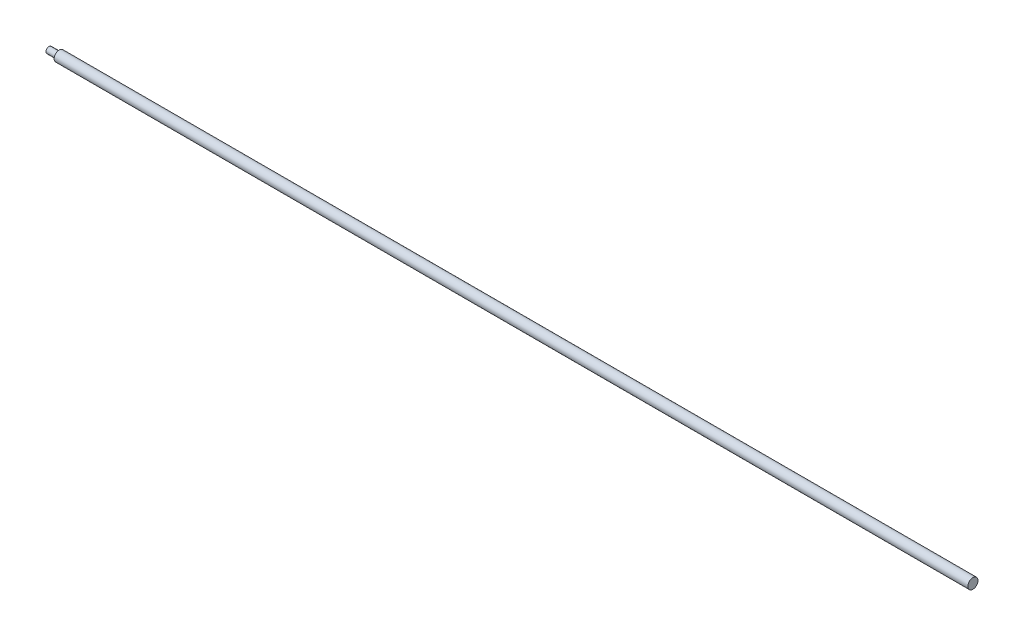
from build123d import *

# Parameters (mm, degrees)
ESQUISSE1_R             = 5
EXTRUSION1_DEPTH        = 910
ESQUISSE2_OUTSIDE_W     = 194.022
ESQUISSE2_OUTSIDE_H     = 194.022
ESQUISSE2_OUTSIDE_R     = 3
ENL_V_MAT_EXTRU_1_DEPTH = 10


with BuildPart() as part:
    # Esquisse1 → Extrusion1 (new body)
    with BuildSketch(Plane(origin=(0, 0, 0), x_dir=(0, 0, -1), z_dir=(1, 0, 0))):
        with Locations(Location((0, 0, 0), (0, 0, 180))):
            Circle(ESQUISSE1_R)
    extrude(amount=EXTRUSION1_DEPTH)

    # Esquisse2 outside → Enl_v. mat.-Extru.1 (cut)
    with BuildSketch(Plane.ZY):
        Rectangle(ESQUISSE2_OUTSIDE_W, ESQUISSE2_OUTSIDE_H)
        Circle(ESQUISSE2_OUTSIDE_R, mode=Mode.SUBTRACT)
    extrude(amount=-ENL_V_MAT_EXTRU_1_DEPTH, mode=Mode.SUBTRACT)


solid = part.part
